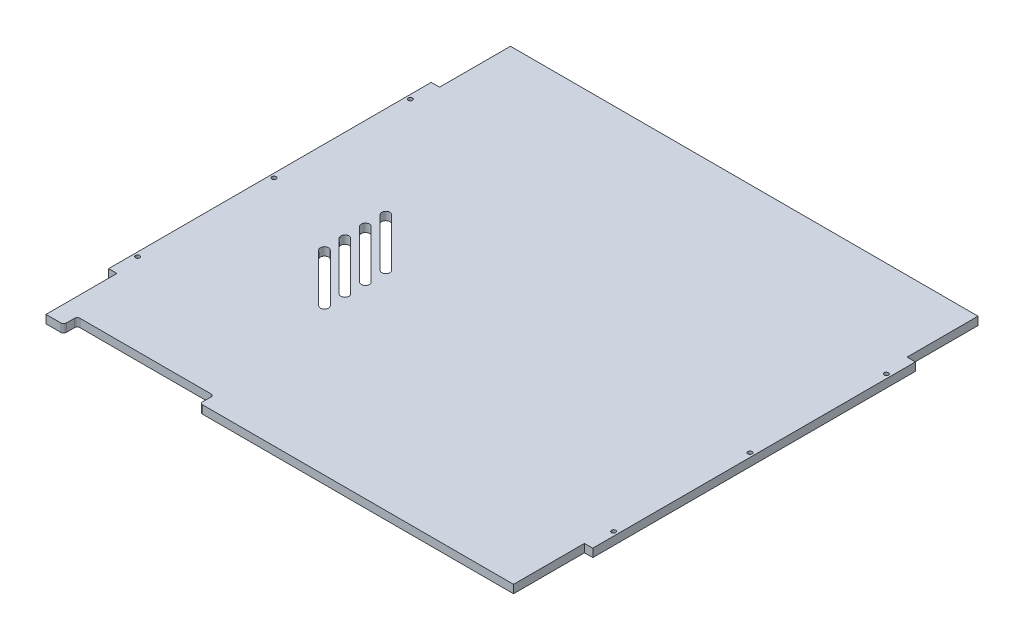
from build123d import *

# Parameters (mm, degrees)
SKETCH_1_W          = 354.95
SKETCH_1_H          = 340.5
EXTRUDE_1_DEPTH     = 6
SKETCH_2_W          = 100
SKETCH_2_H          = 10
CUT_EXTRUDE_1_DEPTH = 247.004955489
SKETCH_3_W          = 6.1
SKETCH_3_H          = 52
CUT_EXTRUDE_2_DEPTH = 247.004955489
CUT_EXTRUDE_3_DEPTH = 247.004955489
FILLET_1_R          = 2
SKETCH_5_R          = 1.55
CUT_EXTRUDE_4_DEPTH = 247.004955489


with BuildPart() as part:
    # Sketch 1 → Extrude 1 (new body)
    with BuildSketch(Plane(origin=(0, 0, 0), x_dir=(1, 0, 0), z_dir=(0, 1, 0))):
        Rectangle(SKETCH_1_W, SKETCH_1_H)
    extrude(amount=EXTRUDE_1_DEPTH)

    # Sketch 2 → Cut-Extrude 1 (cut, through all)
    with BuildSketch(Plane(origin=(0, 6, 0), x_dir=(1, 0, 0), z_dir=(0, 1, 0))):
        with Locations((-108.475, -165.25)):
            Rectangle(SKETCH_2_W, SKETCH_2_H)
    extrude(amount=-CUT_EXTRUDE_1_DEPTH, mode=Mode.SUBTRACT)

    # Sketch 3 → Cut-Extrude 2 (cut, through all)
    with BuildSketch(Plane(origin=(0, 6, 0), x_dir=(1, 0, 0), z_dir=(0, 1, 0))):
        with Locations((174.425, 144.25)):
            Rectangle(SKETCH_3_W, SKETCH_3_H)
        with Locations((174.425, -144.25)):
            Rectangle(SKETCH_3_W, SKETCH_3_H)
        with Locations((-174.425, 144.25)):
            Rectangle(SKETCH_3_W, SKETCH_3_H)
        with Locations((-174.425, -144.25)):
            Rectangle(SKETCH_3_W, SKETCH_3_H)
    extrude(amount=-CUT_EXTRUDE_2_DEPTH, mode=Mode.SUBTRACT)

    # Sketch 4 → Cut-Extrude 3 (cut, through all)
    with BuildSketch(Plane(origin=(0, 6, 0), x_dir=(1, 0, 0), z_dir=(0, 1, 0))):
        with BuildLine():
            Line((-108.031349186, 19.798989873), (-72.676010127, -15.556349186))
            ThreePointArc((-72.676010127, -15.556349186), (-72.676010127, -19.798989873), (-76.918650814, -19.798989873))
            Line((-76.918650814, -19.798989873), (-112.273989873, 15.556349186))
            ThreePointArc((-112.273989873, 15.556349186), (-112.273989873, 19.798989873), (-108.031349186, 19.798989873))
        make_face()
        with BuildLine():
            Line((-108.031349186, 4.798989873), (-72.676010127, -30.556349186))
            ThreePointArc((-72.676010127, -30.556349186), (-72.676010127, -34.798989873), (-76.918650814, -34.798989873))
            Line((-76.918650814, -34.798989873), (-112.273989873, 0.556349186))
            ThreePointArc((-112.273989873, 0.556349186), (-112.273989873, 4.798989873), (-108.031349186, 4.798989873))
        make_face()
        with BuildLine():
            Line((-108.031349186, -10.201010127), (-72.676010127, -45.556349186))
            ThreePointArc((-72.676010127, -45.556349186), (-72.676010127, -49.798989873), (-76.918650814, -49.798989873))
            Line((-76.918650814, -49.798989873), (-112.273989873, -14.443650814))
            ThreePointArc((-112.273989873, -14.443650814), (-112.273989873, -10.201010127), (-108.031349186, -10.201010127))
        make_face()
        with BuildLine():
            Line((-108.031349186, -25.201010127), (-72.676010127, -60.556349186))
            ThreePointArc((-72.676010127, -60.556349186), (-72.676010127, -64.798989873), (-76.918650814, -64.798989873))
            Line((-76.918650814, -64.798989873), (-112.273989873, -29.443650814))
            ThreePointArc((-112.273989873, -29.443650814), (-112.273989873, -25.201010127), (-108.031349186, -25.201010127))
        make_face()
    extrude(amount=-CUT_EXTRUDE_3_DEPTH, mode=Mode.SUBTRACT)

    # Fillet 1
    fillet_1_edges = [part.edges().sort_by_distance(p)[0] for p in [
        (-158.475, 3, 170.25),
        (-158.475, 3, 160.25),
        (-58.475, 3, 160.25),
        (-58.475, 3, 170.25),
    ]]
    fillet(fillet_1_edges, radius=FILLET_1_R)

    # Sketch 5 → Cut-Extrude 4 (cut, through all)
    with BuildSketch(Plane(origin=(0, 6, 0), x_dir=(1, 0, 0), z_dir=(0, 1, 0))):
        with Locations(Location((174.475, 100, 0), (0, 0, 270))):
            Circle(SKETCH_5_R)
        with Locations(Location((174.475, 0, 0), (0, 0, 270))):
            Circle(SKETCH_5_R)
        with Locations(Location((174.475, -100, 0), (0, 0, 90))):
            Circle(SKETCH_5_R)
        with Locations(Location((-174.475, 0, 0), (0, 0, 90))):
            Circle(SKETCH_5_R)
        with Locations(Location((-174.475, 100, 0), (0, 0, 90))):
            Circle(SKETCH_5_R)
        with Locations(Location((-174.475, -100, 0), (0, 0, 270))):
            Circle(SKETCH_5_R)
    extrude(amount=-CUT_EXTRUDE_4_DEPTH, mode=Mode.SUBTRACT)


solid = part.part
